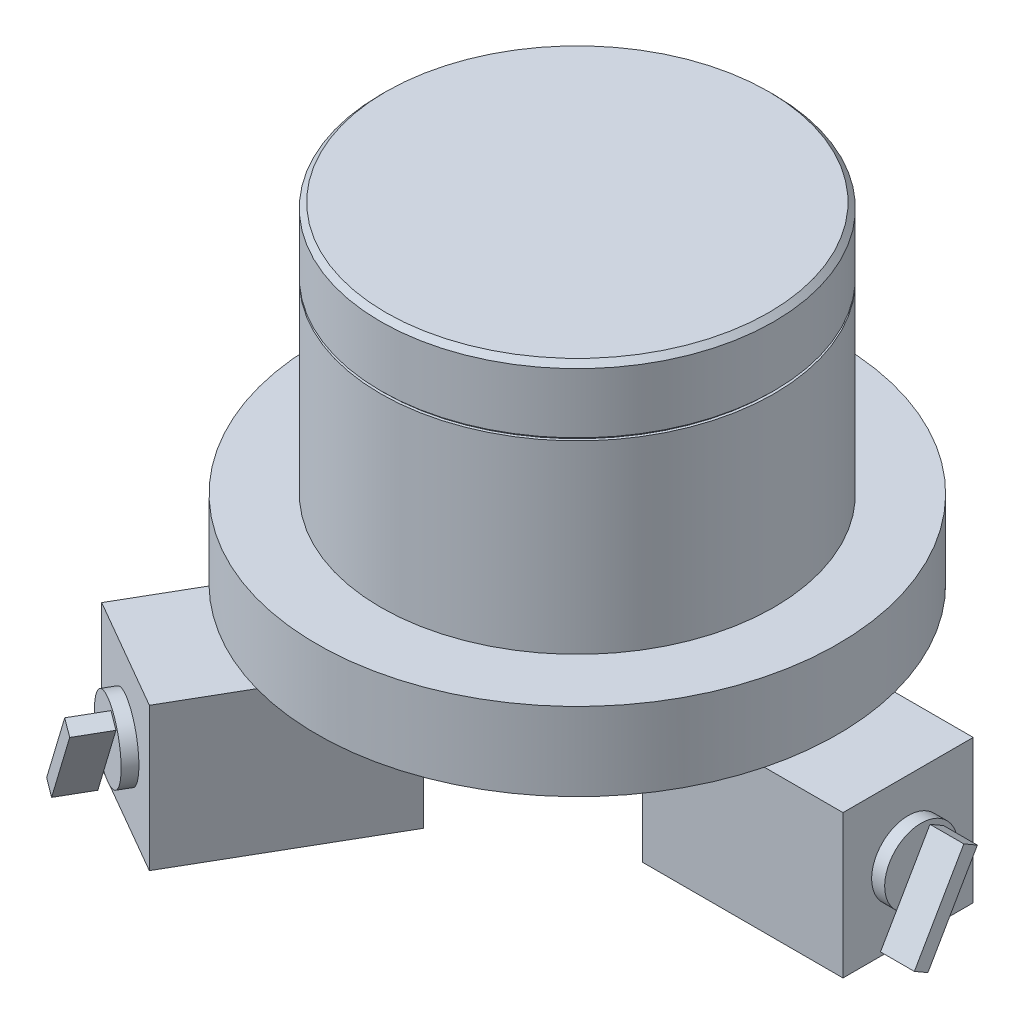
from build123d import *

# Parameters (mm, degrees)
SKIZZE2_W               = 77
SKIZZE2_H               = 50
LINEAR_AUSTRAGEN1_DEPTH = 55
SKIZZE3_R               = 14
LINEAR_AUSTRAGEN2_DEPTH = 5
LINEAR_AUSTRAGEN3_DEPTH = 13
KREISMUSTER1_COUNT      = 3


with BuildPart() as part:
    # Skizze1 → Rotation1 (revolve)
    with BuildSketch(Plane.XY, mode=Mode.PRIVATE) as rotation1_sk:
        Polygon((0, 55), (100, 55), (100, 85), (75.5, 85), (75.5, 156), (74.5, 156), (74.5, 157), (75.5, 157), (75.5, 180), (73.5, 182), (0, 182), align=None)
    revolve(rotation1_sk.sketch.rotate(Axis((0, -14.759459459, 0), (0, 1, 0)), 90), axis=Axis((0, -14.759459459, 0), (0, 1, 0)))

    # Skizze2 → Linear austragen1 (add)
    with BuildSketch(Plane(origin=(0, 55, 0), x_dir=(1, 0, 0), z_dir=(0, 1, 0))):
        with Locations((88.5, 0)):
            Rectangle(SKIZZE2_W, SKIZZE2_H)
    linear_austragen1 = extrude(amount=-LINEAR_AUSTRAGEN1_DEPTH)

    # Skizze3 → Linear austragen2 (add)
    with BuildSketch(Plane(origin=(127, 0, 0), x_dir=(0, 0, -1), z_dir=(1, 0, 0))):
        with Locations((0, 27.5)):
            Circle(SKIZZE3_R)
    linear_austragen2 = extrude(amount=LINEAR_AUSTRAGEN2_DEPTH)

    # Skizze4 → Linear austragen3 (add)
    with BuildSketch(Plane(origin=(132, 0, 0), x_dir=(0, 0, -1), z_dir=(1, 0, 0))):
        Polygon((3.401923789, 39.392304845), (8.598076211, 36.392304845), (-10.401923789, 3.483339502), (-15.598076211, 6.483339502), align=None)
    linear_austragen3 = extrude(amount=LINEAR_AUSTRAGEN3_DEPTH)

    # Kreismuster1: Linear austragen1, Linear austragen2, Linear austragen3 ×3 about axis
    kreismuster1_axis = Axis((0, 0, 0), (0, 1, 0))
    add([linear_austragen1.rotate(kreismuster1_axis, i * 360 / KREISMUSTER1_COUNT) for i in range(1, KREISMUSTER1_COUNT)])
    add([linear_austragen2.rotate(kreismuster1_axis, i * 360 / KREISMUSTER1_COUNT) for i in range(1, KREISMUSTER1_COUNT)])
    add([linear_austragen3.rotate(kreismuster1_axis, i * 360 / KREISMUSTER1_COUNT) for i in range(1, KREISMUSTER1_COUNT)])


solid = part.part
